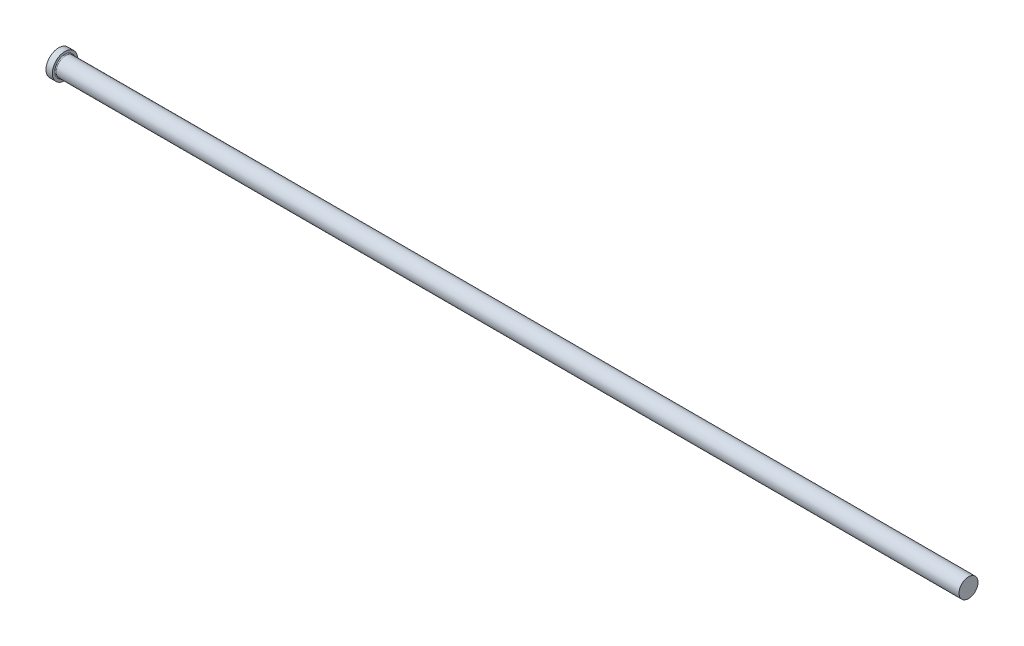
from build123d import *


with BuildPart() as part:
    # Sketch1 → PIN (revolve)
    with BuildSketch(Plane.XY, mode=Mode.PRIVATE) as pin_sk:
        with BuildLine():
            Line((0, 0), (0, 12.7))
            Line((0, 12.7), (6.35, 12.7))
            Line((6.35, 12.7), (6.35, 10.30605))
            ThreePointArc((6.35, 10.30605), (6.58062412, 9.74927412), (7.1374, 9.51865))
            Line((7.1374, 9.51865), (914.4, 9.51865))
            Line((914.4, 9.51865), (914.4, 0))
            Line((914.4, 0), (0, 0))
        make_face()
    revolve(pin_sk.sketch.rotate(Axis((914.4, 0, 0), (-1, 0, 0)), 180), axis=Axis((914.4, 0, 0), (-1, 0, 0)))


solid = part.part
